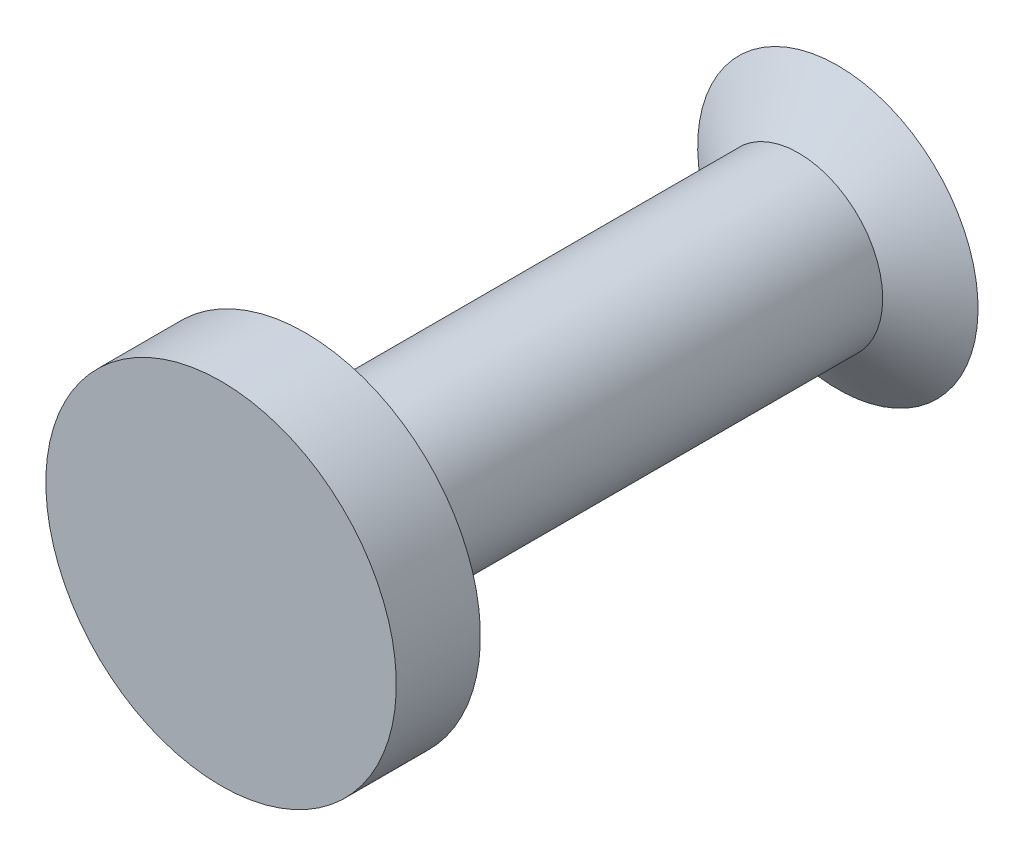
ISO-10303-21;
HEADER;
FILE_DESCRIPTION(('STEP AP214'),'2;1');
FILE_NAME('part.step','',(''),(''),'','','');
FILE_SCHEMA(('AUTOMOTIVE_DESIGN { 1 0 10303 214 1 1 1 1 }'));
ENDSEC;
DATA;
#1=APPLICATION_CONTEXT('core data for automotive mechanical design processes');
#2=APPLICATION_PROTOCOL_DEFINITION('international standard','automotive_design',2000,#1);
#3=PRODUCT_CONTEXT('',#1,'mechanical');
#4=PRODUCT('Part','Part','',(#3));
#5=PRODUCT_RELATED_PRODUCT_CATEGORY('part','',(#4));
#6=PRODUCT_DEFINITION_FORMATION('','',#4);
#7=PRODUCT_DEFINITION_CONTEXT('part definition',#1,'design');
#8=PRODUCT_DEFINITION('design','',#6,#7);
#9=PRODUCT_DEFINITION_SHAPE('','',#8);
#10=(LENGTH_UNIT() NAMED_UNIT(*) SI_UNIT(.MILLI.,.METRE.));
#11=(NAMED_UNIT(*) PLANE_ANGLE_UNIT() SI_UNIT($,.RADIAN.));
#12=(NAMED_UNIT(*) SI_UNIT($,.STERADIAN.) SOLID_ANGLE_UNIT());
#13=UNCERTAINTY_MEASURE_WITH_UNIT(LENGTH_MEASURE(1.E-05),#10,'distance_accuracy_value','');
#14=(GEOMETRIC_REPRESENTATION_CONTEXT(3) GLOBAL_UNCERTAINTY_ASSIGNED_CONTEXT((#13)) GLOBAL_UNIT_ASSIGNED_CONTEXT((#10,
#11,#12)) REPRESENTATION_CONTEXT('',''));
#15=CARTESIAN_POINT('',(0.,0.,0.));
#16=DIRECTION('',(0.,0.,1.));
#17=DIRECTION('',(1.,0.,0.));
#18=AXIS2_PLACEMENT_3D('',#15,#16,#17);
#19=CARTESIAN_POINT('',(0.,0.,0.));
#20=DIRECTION('',(0.,0.,-1.));
#21=DIRECTION('',(0.,1.,0.));
#22=AXIS2_PLACEMENT_3D('',#19,#20,#21);
#23=PLANE('',#22);
#24=CARTESIAN_POINT('',(0.,0.,0.));
#25=DIRECTION('',(0.,0.,-1.));
#26=DIRECTION('',(0.,1.,0.));
#27=AXIS2_PLACEMENT_3D('',#24,#25,#26);
#28=CIRCLE('',#27,1.27);
#29=CARTESIAN_POINT('',(0.,1.27,0.));
#30=VERTEX_POINT('',#29);
#31=EDGE_CURVE('E10',#30,#30,#28,.T.);
#32=ORIENTED_EDGE('',*,*,#31,.T.);
#33=EDGE_LOOP('',(#32));
#34=FACE_BOUND('',#33,.T.);
#35=ADVANCED_FACE('F33',(#34),#23,.T.);
#36=CARTESIAN_POINT('',(0.,0.,0.));
#37=DIRECTION('',(0.,0.,-1.));
#38=DIRECTION('',(0.,1.,0.));
#39=AXIS2_PLACEMENT_3D('',#36,#37,#38);
#40=CONICAL_SURFACE('',#39,1.27,0.959931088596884);
#41=CARTESIAN_POINT('',(0.,0.,0.355705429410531));
#42=DIRECTION('',(0.,0.,-1.));
#43=DIRECTION('',(0.,1.,0.));
#44=AXIS2_PLACEMENT_3D('',#41,#42,#43);
#45=CIRCLE('',#44,0.762);
#46=CARTESIAN_POINT('',(0.,0.762,0.355705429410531));
#47=VERTEX_POINT('',#46);
#48=EDGE_CURVE('E39',#47,#47,#45,.T.);
#49=ORIENTED_EDGE('',*,*,#48,.T.);
#50=EDGE_LOOP('',(#49));
#51=FACE_BOUND('',#50,.T.);
#52=ORIENTED_EDGE('',*,*,#31,.F.);
#53=EDGE_LOOP('',(#52));
#54=FACE_BOUND('',#53,.T.);
#55=ADVANCED_FACE('F68',(#51,#54),#40,.T.);
#56=CARTESIAN_POINT('',(0.,0.,0.));
#57=DIRECTION('',(0.,0.,-1.));
#58=DIRECTION('',(0.,1.,0.));
#59=AXIS2_PLACEMENT_3D('',#56,#57,#58);
#60=CYLINDRICAL_SURFACE('',#59,0.762);
#61=CARTESIAN_POINT('',(0.,0.,4.826));
#62=DIRECTION('',(0.,0.,-1.));
#63=DIRECTION('',(0.,1.,0.));
#64=AXIS2_PLACEMENT_3D('',#61,#62,#63);
#65=CIRCLE('',#64,0.762);
#66=CARTESIAN_POINT('',(0.,0.762,4.826));
#67=VERTEX_POINT('',#66);
#68=EDGE_CURVE('E43',#67,#67,#65,.T.);
#69=ORIENTED_EDGE('',*,*,#68,.T.);
#70=EDGE_LOOP('',(#69));
#71=FACE_BOUND('',#70,.T.);
#72=ORIENTED_EDGE('',*,*,#48,.F.);
#73=EDGE_LOOP('',(#72));
#74=FACE_BOUND('',#73,.T.);
#75=ADVANCED_FACE('F72',(#71,#74),#60,.T.);
#76=CARTESIAN_POINT('',(0.,0.762,4.826));
#77=DIRECTION('',(0.,0.,-1.));
#78=DIRECTION('',(0.,1.,0.));
#79=AXIS2_PLACEMENT_3D('',#76,#77,#78);
#80=PLANE('',#79);
#81=CARTESIAN_POINT('',(0.,0.,4.826));
#82=DIRECTION('',(0.,0.,-1.));
#83=DIRECTION('',(0.,1.,0.));
#84=AXIS2_PLACEMENT_3D('',#81,#82,#83);
#85=CIRCLE('',#84,1.5875);
#86=CARTESIAN_POINT('',(0.,1.5875,4.826));
#87=VERTEX_POINT('',#86);
#88=EDGE_CURVE('E47',#87,#87,#85,.T.);
#89=ORIENTED_EDGE('',*,*,#88,.T.);
#90=EDGE_LOOP('',(#89));
#91=FACE_BOUND('',#90,.T.);
#92=ORIENTED_EDGE('',*,*,#68,.F.);
#93=EDGE_LOOP('',(#92));
#94=FACE_BOUND('',#93,.T.);
#95=ADVANCED_FACE('F65',(#91,#94),#80,.T.);
#96=CARTESIAN_POINT('',(0.,0.,0.));
#97=DIRECTION('',(0.,0.,-1.));
#98=DIRECTION('',(0.,1.,0.));
#99=AXIS2_PLACEMENT_3D('',#96,#97,#98);
#100=CYLINDRICAL_SURFACE('',#99,1.5875);
#101=CARTESIAN_POINT('',(0.,0.,5.588));
#102=DIRECTION('',(0.,0.,-1.));
#103=DIRECTION('',(0.,1.,0.));
#104=AXIS2_PLACEMENT_3D('',#101,#102,#103);
#105=CIRCLE('',#104,1.5875);
#106=CARTESIAN_POINT('',(0.,1.5875,5.588));
#107=VERTEX_POINT('',#106);
#108=EDGE_CURVE('E52',#107,#107,#105,.T.);
#109=ORIENTED_EDGE('',*,*,#108,.T.);
#110=EDGE_LOOP('',(#109));
#111=FACE_BOUND('',#110,.T.);
#112=ORIENTED_EDGE('',*,*,#88,.F.);
#113=EDGE_LOOP('',(#112));
#114=FACE_BOUND('',#113,.T.);
#115=ADVANCED_FACE('F56',(#111,#114),#100,.T.);
#116=CARTESIAN_POINT('',(0.,1.5875,5.588));
#117=DIRECTION('',(0.,0.,1.));
#118=DIRECTION('',(0.,-1.,0.));
#119=AXIS2_PLACEMENT_3D('',#116,#117,#118);
#120=PLANE('',#119);
#121=ORIENTED_EDGE('',*,*,#108,.F.);
#122=EDGE_LOOP('',(#121));
#123=FACE_BOUND('',#122,.T.);
#124=ADVANCED_FACE('F59',(#123),#120,.T.);
#125=CLOSED_SHELL('',(#35,#55,#75,#95,#115,#124));
#126=MANIFOLD_SOLID_BREP('B2',#125);
#127=ADVANCED_BREP_SHAPE_REPRESENTATION('',(#18,#126),#14);
#128=SHAPE_DEFINITION_REPRESENTATION(#9,#127);
ENDSEC;
END-ISO-10303-21;
